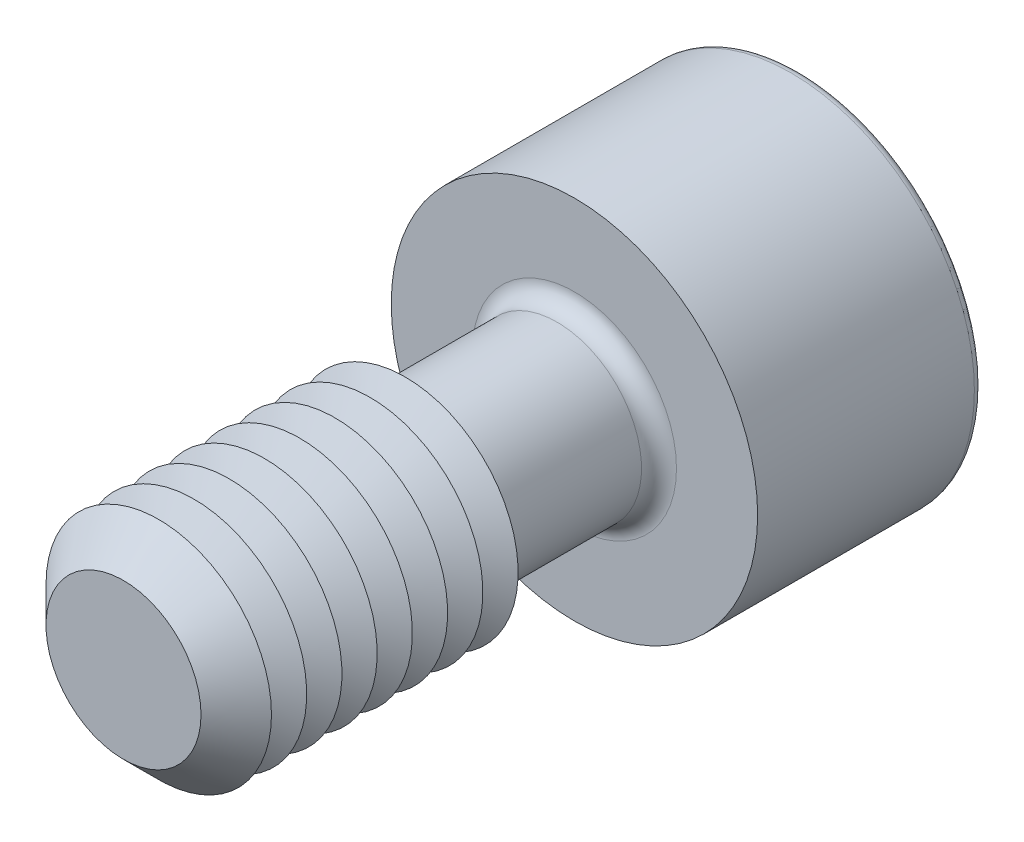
from build123d import *

# Parameters (mm, degrees)
SKETCH1_R       = 3
EXTRUDE1_DEPTH  = 8
CHAMFER1_SIZE   = 1.25
SKETCH3_R       = 6.5
EXTRUDE2_DEPTH  = 8
EXTRUDE3_DEPTH  = 6
FILLET1_R       = 0.62
FILLET2_R       = 0.31
LPATTERN1_COUNT = 7
LPATTERN1_PITCH = 1.25


with BuildPart() as part:
    # Sketch1 → Extrude1 (new, symmetric)
    with BuildSketch(Plane.XY):
        Circle(SKETCH1_R)
    extrude(amount=EXTRUDE1_DEPTH, both=True)

    # Sketch2 → Revolve1 (revolve)
    with BuildSketch(Plane(origin=(0, 0, 0), x_dir=(0, 0, -1), z_dir=(1, 0, 0))):
        Polygon((-8, 0), (-8, 4), (2, 4), (2.577350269, 3), (2.577350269, 0), align=None)
    revolve(axis=Axis((0, 0, -2.577350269), (0, 0, 1)))

    # Chamfer1
    chamfer1_edges = [part.edges().sort_by_distance(p)[0] for p in [
        (0, -4, 8),
    ]]
    chamfer(chamfer1_edges, length=CHAMFER1_SIZE)

    # Sketch3 → Extrude2 (add)
    with BuildSketch(Plane(origin=(0, 0, -8), x_dir=(-1, 0, 0), z_dir=(0, 0, -1))):
        Circle(SKETCH3_R)
    extrude(amount=EXTRUDE2_DEPTH)

    # Sketch4 → Extrude3 (cut)
    with BuildSketch(Plane(origin=(-13.7, 0, -16), x_dir=(1, 0, 0), z_dir=(0, 0, 1))):
        Polygon((11.967949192, -3), (15.432050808, -3), (17.164101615, 0), (15.432050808, 3), (11.967949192, 3), (10.235898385, 0), align=None)
    extrude(amount=EXTRUDE3_DEPTH, mode=Mode.SUBTRACT)

    # Fillet1
    fillet1_edges = [part.edges().sort_by_distance(p)[0] for p in [
        (-3, 0, -8),
    ]]
    fillet(fillet1_edges, radius=FILLET1_R)

    # Fillet2
    fillet2_edges = [part.edges().sort_by_distance(p)[0] for p in [
        (6.5, 0, -16),
    ]]
    fillet(fillet2_edges, radius=FILLET2_R)

    # Sketch5 → Cut-Revolve1 (revolve, cut)
    with BuildSketch(Plane(origin=(0, 0, 0), x_dir=(0, 0, -1), z_dir=(1, 0, 0)), mode=Mode.PRIVATE) as cut_revolve1_sk:
        Polygon((10, 0), (10, -3), (8.267949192, 0), align=None)
    revolve(cut_revolve1_sk.sketch.rotate(Axis((0, 0, -8.267949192), (0, 0, -1)), 90), axis=Axis((0, 0, -8.267949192), (0, 0, -1)), mode=Mode.SUBTRACT)

    # Sketch7 → Cut-Revolve2 (revolve, cut)
    with BuildSketch(Plane(origin=(0, 0, 0), x_dir=(0, 0, -1), z_dir=(1, 0, 0)), mode=Mode.PRIVATE) as cut_revolve2_sk:
        Polygon((2, 4), (1.375, 2.917468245), (0.75, 4), align=None)
    cut_revolve2 = revolve(cut_revolve2_sk.sketch.rotate(Axis((0, 0, -1.332048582), (0, 0, 1)), 90), axis=Axis((0, 0, -1.332048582), (0, 0, 1)), mode=Mode.SUBTRACT)

    # LPattern1: Cut-Revolve2 ×7
    with Locations(*[(0, 0, i * LPATTERN1_PITCH) for i in range(1, LPATTERN1_COUNT)]):
        add(cut_revolve2, mode=Mode.SUBTRACT)


solid = part.part
